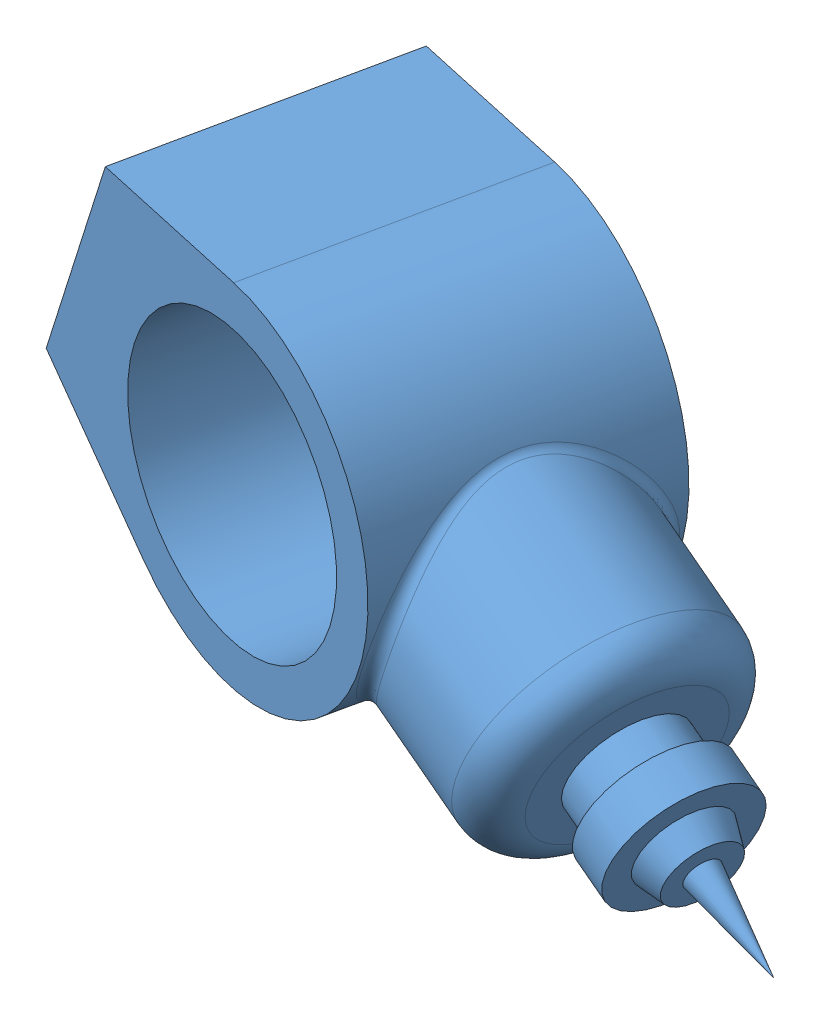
SolidWorks assembly Assembly.SLDASM, configuration Default (file format 15000). Lengths in mm.
Overall size (1284.38 988.06 556.05).
5 component instances, 5 part files, 8 mates.
Components (placement in the parent):
- Base-1: Base.SLDPRT [Default] at (227.9739 190.1553 387.4975) size (555 280 555)
- Link_1-1: Link_1.SLDPRT [Default] at (227.9739 350.1553 387.4975) x (0.978371 0 0.206858) z (-0.206858 0 0.978371) size (320 466 320)
- Link_2-1: Link_2.SLDPRT [Default] at (227.9739 686.1553 387.4975) x (0.537272 -0.835724 0.113596) z (-0.817648 -0.54915 -0.172876) size (250 260.14 700)
- Link_3-1: Link_3.SLDPRT [Default] at (677.1299 1127.1975 492.6843) x (0.665497 -0.733018 0.140707) z (-0.206858 0 0.978371) size (595 297.5 160)
- Link_4-1: Link_4.SLDPRT [Default] at (1023.188 746.0279 565.8518) x (0.915171 -0.353584 0.193496) z (0.206858 0 -0.978371) size (275 130 104.18)
Mates (geometry in assembly coordinates):
- Concentric1: concentric anti-aligned: cylinder of Base-1 through (227.9739 270.1553 387.4975) axis (0 1 0) radius 100; cylinder of Link_1-1 through (227.9739 470.1553 387.4975) axis (0 -1 0) radius 100
- Coincident1: coincident anti-aligned: plane of Base-1 through (227.9739 470.1553 387.4975) normal (0 1 0); plane of Link_1-1 through (227.9739 470.1553 387.4975) normal (0 -1 0)
- Concentric2: concentric: cylinder of Link_1-1 through (317.9738 686.1553 387.6129) axis (-0.999999 0 -0.001282) radius 79.5; cylinder of Link_2-1 through (317.9738 686.1553 387.6129) axis (-0.999999 0 -0.001282) radius 75
- Coincident2: coincident: plane of Link_1-1 through (137.974 686.1553 387.3822) normal (-0.999999 0 -0.001282); plane of Link_2-1 through (138.1333 986.4421 263.0858) normal (0.999999 0 0.001282)
- Concentric3: concentric: cylinder of Link_2-1 through (318.6144 699.0174 -112.2213) axis (-0.999999 0 -0.001282) radius 50; cylinder of Link_3-1 through (318.6144 699.0174 -112.2213) axis (-0.999999 0 -0.001282) radius 50
- Coincident3: coincident: plane of Link_2-1 through (318.1331 986.4421 263.3164) normal (-0.999999 0 -0.001282); plane of Link_3-1 through (318.6144 699.0174 -112.2213) normal (0.999999 0 0.001282)
- Coincident5: coincident: plane of Link_3-1 through (189.1926 713.9141 -563.5206) normal (0.999999 0 0.001282); plane of Link_4-1 through (189.1926 713.9141 -563.5206) normal (-0.999999 0 -0.001282)
- Concentric7: concentric: cylinder of Link_3-1 through (319.1945 713.9141 -563.354) axis (-0.999999 0 -0.001282) radius 50; cylinder of Link_4-1 through (189.1926 713.9141 -563.5206) axis (0.999999 0 0.001282) radius 50
